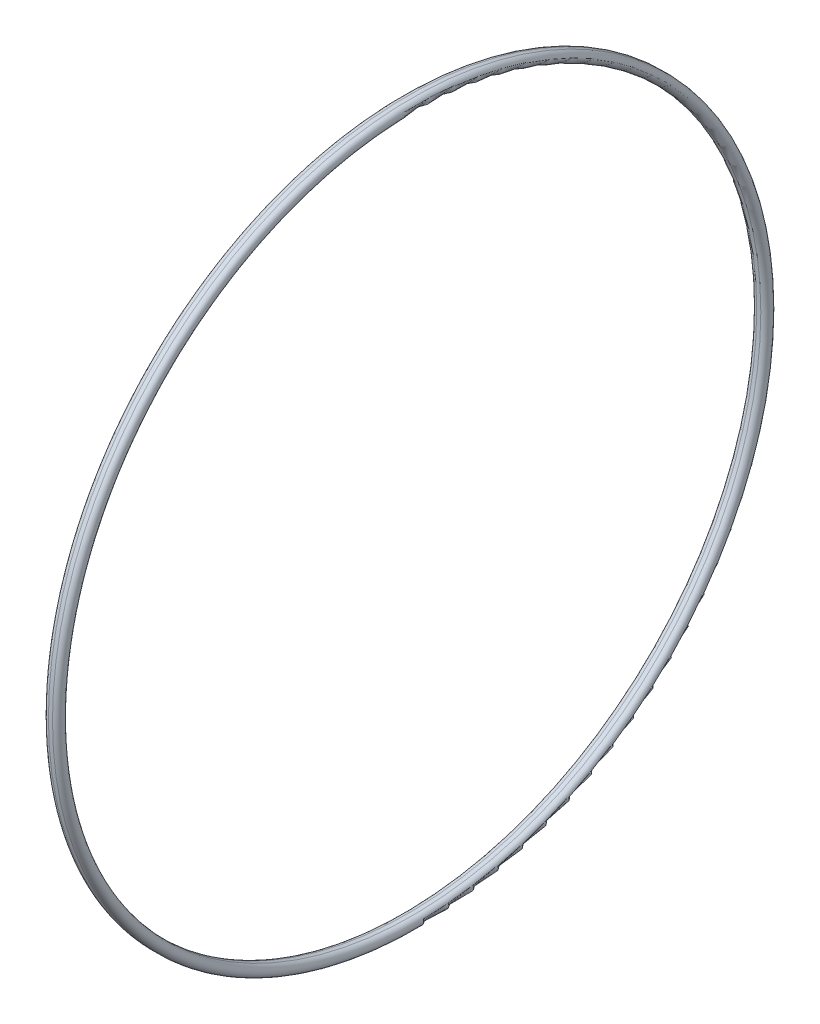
ISO-10303-21;
HEADER;
FILE_DESCRIPTION(('STEP AP214'),'2;1');
FILE_NAME('part.step','',(''),(''),'','','');
FILE_SCHEMA(('AUTOMOTIVE_DESIGN { 1 0 10303 214 1 1 1 1 }'));
ENDSEC;
DATA;
#1=APPLICATION_CONTEXT('core data for automotive mechanical design processes');
#2=APPLICATION_PROTOCOL_DEFINITION('international standard','automotive_design',2000,#1);
#3=PRODUCT_CONTEXT('',#1,'mechanical');
#4=PRODUCT('Part','Part','',(#3));
#5=PRODUCT_RELATED_PRODUCT_CATEGORY('part','',(#4));
#6=PRODUCT_DEFINITION_FORMATION('','',#4);
#7=PRODUCT_DEFINITION_CONTEXT('part definition',#1,'design');
#8=PRODUCT_DEFINITION('design','',#6,#7);
#9=PRODUCT_DEFINITION_SHAPE('','',#8);
#10=(LENGTH_UNIT() NAMED_UNIT(*) SI_UNIT(.MILLI.,.METRE.));
#11=(NAMED_UNIT(*) PLANE_ANGLE_UNIT() SI_UNIT($,.RADIAN.));
#12=(NAMED_UNIT(*) SI_UNIT($,.STERADIAN.) SOLID_ANGLE_UNIT());
#13=UNCERTAINTY_MEASURE_WITH_UNIT(LENGTH_MEASURE(1.E-05),#10,'distance_accuracy_value','');
#14=(GEOMETRIC_REPRESENTATION_CONTEXT(3) GLOBAL_UNCERTAINTY_ASSIGNED_CONTEXT((#13)) GLOBAL_UNIT_ASSIGNED_CONTEXT((#10,
#11,#12)) REPRESENTATION_CONTEXT('',''));
#15=CARTESIAN_POINT('',(0.,0.,0.));
#16=DIRECTION('',(0.,0.,1.));
#17=DIRECTION('',(1.,0.,0.));
#18=AXIS2_PLACEMENT_3D('',#15,#16,#17);
#19=CARTESIAN_POINT('',(-1.07950000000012,0.,0.));
#20=DIRECTION('',(1.,0.,0.));
#21=DIRECTION('',(0.,0.,-1.00000000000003));
#22=AXIS2_PLACEMENT_3D('',#19,#20,#21);
#23=TOROIDAL_SURFACE('',#22,187.6298,2.85750000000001);
#24=CARTESIAN_POINT('',(-1.07950000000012,0.,0.));
#25=DIRECTION('',(1.,0.,0.));
#26=DIRECTION('',(0.,0.,-1.00000000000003));
#27=AXIS2_PLACEMENT_3D('',#24,#25,#26);
#28=CIRCLE('',#27,184.7723);
#29=CARTESIAN_POINT('',(-1.07950000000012,0.,-184.772300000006));
#30=VERTEX_POINT('',#29);
#31=EDGE_CURVE('E10',#30,#30,#28,.T.);
#32=ORIENTED_EDGE('',*,*,#31,.T.);
#33=EDGE_LOOP('',(#32));
#34=FACE_BOUND('',#33,.T.);
#35=CARTESIAN_POINT('',(-1.07950000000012,0.,0.));
#36=DIRECTION('',(1.,0.,0.));
#37=DIRECTION('',(0.,0.,-1.00000000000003));
#38=AXIS2_PLACEMENT_3D('',#35,#36,#37);
#39=CIRCLE('',#38,190.4873);
#40=CARTESIAN_POINT('',(-1.07950000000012,0.,-190.487300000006));
#41=VERTEX_POINT('',#40);
#42=EDGE_CURVE('E393',#41,#41,#39,.T.);
#43=ORIENTED_EDGE('',*,*,#42,.F.);
#44=EDGE_LOOP('',(#43));
#45=FACE_BOUND('',#44,.T.);
#46=ADVANCED_FACE('F379',(#34,#45),#23,.T.);
#47=CARTESIAN_POINT('',(154.141395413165,0.,0.));
#48=DIRECTION('',(1.,0.,0.));
#49=DIRECTION('',(0.,0.,-1.00000000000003));
#50=AXIS2_PLACEMENT_3D('',#47,#48,#49);
#51=CYLINDRICAL_SURFACE('',#50,184.7723);
#52=CARTESIAN_POINT('',(1.07950000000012,0.,0.));
#53=DIRECTION('',(1.,0.,0.));
#54=DIRECTION('',(0.,0.,-1.00000000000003));
#55=AXIS2_PLACEMENT_3D('',#52,#53,#54);
#56=CIRCLE('',#55,184.7723);
#57=CARTESIAN_POINT('',(1.07950000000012,0.,-184.772300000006));
#58=VERTEX_POINT('',#57);
#59=EDGE_CURVE('E385',#58,#58,#56,.T.);
#60=ORIENTED_EDGE('',*,*,#59,.T.);
#61=EDGE_LOOP('',(#60));
#62=FACE_BOUND('',#61,.T.);
#63=ORIENTED_EDGE('',*,*,#31,.F.);
#64=EDGE_LOOP('',(#63));
#65=FACE_BOUND('',#64,.T.);
#66=ADVANCED_FACE('F403',(#62,#65),#51,.F.);
#67=CARTESIAN_POINT('',(1.07950000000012,0.,0.));
#68=DIRECTION('',(1.,0.,0.));
#69=DIRECTION('',(0.,0.,-1.00000000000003));
#70=AXIS2_PLACEMENT_3D('',#67,#68,#69);
#71=TOROIDAL_SURFACE('',#70,187.6298,2.85750000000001);
#72=CARTESIAN_POINT('',(1.07950000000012,0.,0.));
#73=DIRECTION('',(1.,0.,0.));
#74=DIRECTION('',(0.,0.,-1.00000000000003));
#75=AXIS2_PLACEMENT_3D('',#72,#73,#74);
#76=CIRCLE('',#75,190.4873);
#77=CARTESIAN_POINT('',(1.07950000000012,0.,-190.487300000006));
#78=VERTEX_POINT('',#77);
#79=EDGE_CURVE('E389',#78,#78,#76,.T.);
#80=ORIENTED_EDGE('',*,*,#79,.T.);
#81=EDGE_LOOP('',(#80));
#82=FACE_BOUND('',#81,.T.);
#83=ORIENTED_EDGE('',*,*,#59,.F.);
#84=EDGE_LOOP('',(#83));
#85=FACE_BOUND('',#84,.T.);
#86=ADVANCED_FACE('F407',(#82,#85),#71,.T.);
#87=CARTESIAN_POINT('',(154.141395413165,0.,0.));
#88=DIRECTION('',(1.,0.,0.));
#89=DIRECTION('',(0.,0.,-1.00000000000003));
#90=AXIS2_PLACEMENT_3D('',#87,#88,#89);
#91=CYLINDRICAL_SURFACE('',#90,190.4873);
#92=ORIENTED_EDGE('',*,*,#42,.T.);
#93=EDGE_LOOP('',(#92));
#94=FACE_BOUND('',#93,.T.);
#95=ORIENTED_EDGE('',*,*,#79,.F.);
#96=EDGE_LOOP('',(#95));
#97=FACE_BOUND('',#96,.T.);
#98=ADVANCED_FACE('F399',(#94,#97),#91,.T.);
#99=CLOSED_SHELL('',(#46,#66,#86,#98));
#100=MANIFOLD_SOLID_BREP('B2',#99);
#101=ADVANCED_BREP_SHAPE_REPRESENTATION('',(#18,#100),#14);
#102=SHAPE_DEFINITION_REPRESENTATION(#9,#101);
ENDSEC;
END-ISO-10303-21;
